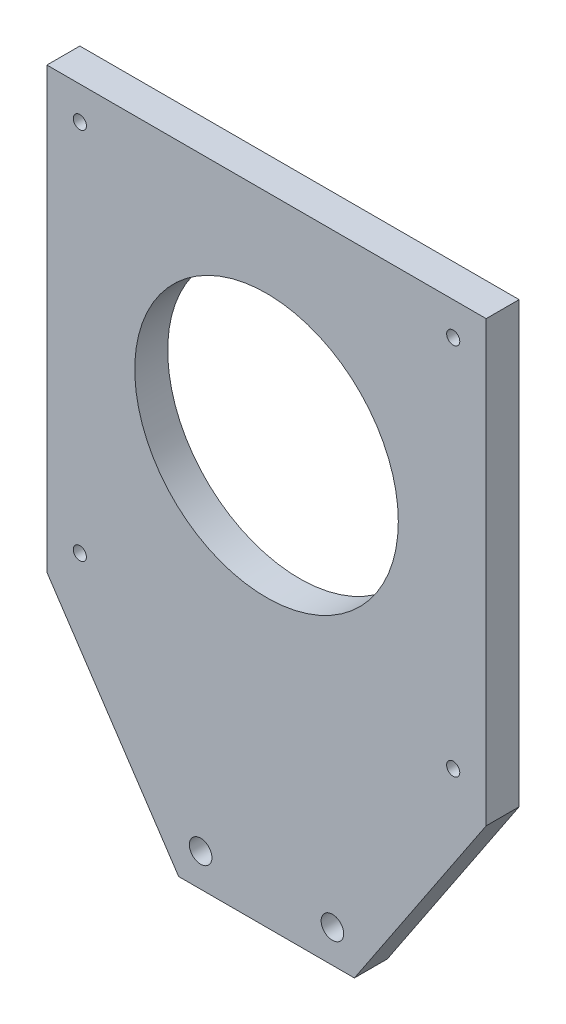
ISO-10303-21;
HEADER;
FILE_DESCRIPTION(('STEP AP214'),'2;1');
FILE_NAME('part.step','',(''),(''),'','','');
FILE_SCHEMA(('AUTOMOTIVE_DESIGN { 1 0 10303 214 1 1 1 1 }'));
ENDSEC;
DATA;
#1=APPLICATION_CONTEXT('core data for automotive mechanical design processes');
#2=APPLICATION_PROTOCOL_DEFINITION('international standard','automotive_design',2000,#1);
#3=PRODUCT_CONTEXT('',#1,'mechanical');
#4=PRODUCT('Part','Part','',(#3));
#5=PRODUCT_RELATED_PRODUCT_CATEGORY('part','',(#4));
#6=PRODUCT_DEFINITION_FORMATION('','',#4);
#7=PRODUCT_DEFINITION_CONTEXT('part definition',#1,'design');
#8=PRODUCT_DEFINITION('design','',#6,#7);
#9=PRODUCT_DEFINITION_SHAPE('','',#8);
#10=(LENGTH_UNIT() NAMED_UNIT(*) SI_UNIT(.MILLI.,.METRE.));
#11=(NAMED_UNIT(*) PLANE_ANGLE_UNIT() SI_UNIT($,.RADIAN.));
#12=(NAMED_UNIT(*) SI_UNIT($,.STERADIAN.) SOLID_ANGLE_UNIT());
#13=UNCERTAINTY_MEASURE_WITH_UNIT(LENGTH_MEASURE(1.E-05),#10,'distance_accuracy_value','');
#14=(GEOMETRIC_REPRESENTATION_CONTEXT(3) GLOBAL_UNCERTAINTY_ASSIGNED_CONTEXT((#13)) GLOBAL_UNIT_ASSIGNED_CONTEXT((#10,
#11,#12)) REPRESENTATION_CONTEXT('',''));
#15=CARTESIAN_POINT('',(0.,0.,0.));
#16=DIRECTION('',(0.,0.,1.));
#17=DIRECTION('',(1.,0.,0.));
#18=AXIS2_PLACEMENT_3D('',#15,#16,#17);
#19=CARTESIAN_POINT('',(-63.4999999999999,-63.5,9.525));
#20=DIRECTION('',(1.,0.,0.));
#21=DIRECTION('',(0.,0.,-1.));
#22=AXIS2_PLACEMENT_3D('',#19,#20,#21);
#23=PLANE('',#22);
#24=DIRECTION('',(0.,-1.,0.));
#25=VECTOR('',#24,1.);
#26=CARTESIAN_POINT('',(-63.4999999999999,-63.5,0.));
#27=LINE('',#26,#25);
#28=CARTESIAN_POINT('',(-63.4999999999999,63.5,0.));
#29=VERTEX_POINT('',#28);
#30=CARTESIAN_POINT('',(-63.4999999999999,-63.5,0.));
#31=VERTEX_POINT('',#30);
#32=EDGE_CURVE('E117',#29,#31,#27,.T.);
#33=ORIENTED_EDGE('',*,*,#32,.T.);
#34=DIRECTION('',(0.,0.,-1.));
#35=VECTOR('',#34,1.);
#36=CARTESIAN_POINT('',(-63.4999999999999,-63.5,9.525));
#37=LINE('',#36,#35);
#38=CARTESIAN_POINT('',(-63.4999999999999,-63.5,9.525));
#39=VERTEX_POINT('',#38);
#40=EDGE_CURVE('E11',#39,#31,#37,.T.);
#41=ORIENTED_EDGE('',*,*,#40,.F.);
#42=DIRECTION('',(0.,-1.,0.));
#43=VECTOR('',#42,1.);
#44=CARTESIAN_POINT('',(-63.4999999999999,-63.5,9.525));
#45=LINE('',#44,#43);
#46=CARTESIAN_POINT('',(-63.4999999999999,63.5,9.525));
#47=VERTEX_POINT('',#46);
#48=EDGE_CURVE('E128',#47,#39,#45,.T.);
#49=ORIENTED_EDGE('',*,*,#48,.F.);
#50=DIRECTION('',(0.,0.,-1.));
#51=VECTOR('',#50,1.);
#52=CARTESIAN_POINT('',(-63.4999999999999,63.5,9.525));
#53=LINE('',#52,#51);
#54=EDGE_CURVE('E113',#47,#29,#53,.T.);
#55=ORIENTED_EDGE('',*,*,#54,.T.);
#56=EDGE_LOOP('',(#33,#41,#49,#55));
#57=FACE_BOUND('',#56,.T.);
#58=ADVANCED_FACE('F33',(#57),#23,.F.);
#59=CARTESIAN_POINT('',(-25.4,-120.65,9.525));
#60=DIRECTION('',(0.832050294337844,0.554700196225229,0.));
#61=DIRECTION('',(-0.554700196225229,0.832050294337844,0.));
#62=AXIS2_PLACEMENT_3D('',#59,#60,#61);
#63=PLANE('',#62);
#64=DIRECTION('',(0.554700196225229,-0.832050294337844,0.));
#65=VECTOR('',#64,1.);
#66=CARTESIAN_POINT('',(-25.4,-120.65,0.));
#67=LINE('',#66,#65);
#68=CARTESIAN_POINT('',(-25.4,-120.65,0.));
#69=VERTEX_POINT('',#68);
#70=EDGE_CURVE('E120',#31,#69,#67,.T.);
#71=ORIENTED_EDGE('',*,*,#70,.T.);
#72=DIRECTION('',(0.,0.,-1.));
#73=VECTOR('',#72,1.);
#74=CARTESIAN_POINT('',(-25.4,-120.65,9.525));
#75=LINE('',#74,#73);
#76=CARTESIAN_POINT('',(-25.4,-120.65,9.525));
#77=VERTEX_POINT('',#76);
#78=EDGE_CURVE('E41',#77,#69,#75,.T.);
#79=ORIENTED_EDGE('',*,*,#78,.F.);
#80=DIRECTION('',(0.554700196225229,-0.832050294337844,0.));
#81=VECTOR('',#80,1.);
#82=CARTESIAN_POINT('',(-25.4,-120.65,9.525));
#83=LINE('',#82,#81);
#84=EDGE_CURVE('E86',#39,#77,#83,.T.);
#85=ORIENTED_EDGE('',*,*,#84,.F.);
#86=ORIENTED_EDGE('',*,*,#40,.T.);
#87=EDGE_LOOP('',(#71,#79,#85,#86));
#88=FACE_BOUND('',#87,.T.);
#89=ADVANCED_FACE('F154',(#88),#63,.F.);
#90=CARTESIAN_POINT('',(25.4,-120.65,9.525));
#91=DIRECTION('',(0.,1.,0.));
#92=DIRECTION('',(0.,0.,1.));
#93=AXIS2_PLACEMENT_3D('',#90,#91,#92);
#94=PLANE('',#93);
#95=DIRECTION('',(1.,0.,0.));
#96=VECTOR('',#95,1.);
#97=CARTESIAN_POINT('',(25.4,-120.65,0.));
#98=LINE('',#97,#96);
#99=CARTESIAN_POINT('',(25.4,-120.65,0.));
#100=VERTEX_POINT('',#99);
#101=EDGE_CURVE('E123',#69,#100,#98,.T.);
#102=ORIENTED_EDGE('',*,*,#101,.T.);
#103=DIRECTION('',(0.,0.,-1.));
#104=VECTOR('',#103,1.);
#105=CARTESIAN_POINT('',(25.4,-120.65,9.525));
#106=LINE('',#105,#104);
#107=CARTESIAN_POINT('',(25.4,-120.65,9.525));
#108=VERTEX_POINT('',#107);
#109=EDGE_CURVE('E108',#108,#100,#106,.T.);
#110=ORIENTED_EDGE('',*,*,#109,.F.);
#111=DIRECTION('',(1.,0.,0.));
#112=VECTOR('',#111,1.);
#113=CARTESIAN_POINT('',(25.4,-120.65,9.525));
#114=LINE('',#113,#112);
#115=EDGE_CURVE('E99',#77,#108,#114,.T.);
#116=ORIENTED_EDGE('',*,*,#115,.F.);
#117=ORIENTED_EDGE('',*,*,#78,.T.);
#118=EDGE_LOOP('',(#102,#110,#116,#117));
#119=FACE_BOUND('',#118,.T.);
#120=ADVANCED_FACE('F134',(#119),#94,.F.);
#121=CARTESIAN_POINT('',(63.5,-63.5,9.525));
#122=DIRECTION('',(-0.832050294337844,0.554700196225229,0.));
#123=DIRECTION('',(-0.554700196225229,-0.832050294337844,0.));
#124=AXIS2_PLACEMENT_3D('',#121,#122,#123);
#125=PLANE('',#124);
#126=DIRECTION('',(0.554700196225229,0.832050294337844,0.));
#127=VECTOR('',#126,1.);
#128=CARTESIAN_POINT('',(63.5,-63.5,0.));
#129=LINE('',#128,#127);
#130=CARTESIAN_POINT('',(63.5,-63.5,0.));
#131=VERTEX_POINT('',#130);
#132=EDGE_CURVE('E107',#100,#131,#129,.T.);
#133=ORIENTED_EDGE('',*,*,#132,.T.);
#134=DIRECTION('',(0.,0.,-1.));
#135=VECTOR('',#134,1.);
#136=CARTESIAN_POINT('',(63.5,-63.5,9.525));
#137=LINE('',#136,#135);
#138=CARTESIAN_POINT('',(63.5,-63.5,9.525));
#139=VERTEX_POINT('',#138);
#140=EDGE_CURVE('E104',#139,#131,#137,.T.);
#141=ORIENTED_EDGE('',*,*,#140,.F.);
#142=DIRECTION('',(0.554700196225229,0.832050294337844,0.));
#143=VECTOR('',#142,1.);
#144=CARTESIAN_POINT('',(63.5,-63.5,9.525));
#145=LINE('',#144,#143);
#146=EDGE_CURVE('E93',#108,#139,#145,.T.);
#147=ORIENTED_EDGE('',*,*,#146,.F.);
#148=ORIENTED_EDGE('',*,*,#109,.T.);
#149=EDGE_LOOP('',(#133,#141,#147,#148));
#150=FACE_BOUND('',#149,.T.);
#151=ADVANCED_FACE('F105',(#150),#125,.F.);
#152=CARTESIAN_POINT('',(63.5000000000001,63.5,9.525));
#153=DIRECTION('',(-1.,0.,0.));
#154=DIRECTION('',(0.,-1.,0.));
#155=AXIS2_PLACEMENT_3D('',#152,#153,#154);
#156=PLANE('',#155);
#157=DIRECTION('',(0.,1.,0.));
#158=VECTOR('',#157,1.);
#159=CARTESIAN_POINT('',(63.5000000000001,63.5,0.));
#160=LINE('',#159,#158);
#161=CARTESIAN_POINT('',(63.5000000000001,63.5,0.));
#162=VERTEX_POINT('',#161);
#163=EDGE_CURVE('E72',#131,#162,#160,.T.);
#164=ORIENTED_EDGE('',*,*,#163,.T.);
#165=DIRECTION('',(0.,0.,-1.));
#166=VECTOR('',#165,1.);
#167=CARTESIAN_POINT('',(63.5000000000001,63.5,9.525));
#168=LINE('',#167,#166);
#169=CARTESIAN_POINT('',(63.5000000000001,63.5,9.525));
#170=VERTEX_POINT('',#169);
#171=EDGE_CURVE('E109',#170,#162,#168,.T.);
#172=ORIENTED_EDGE('',*,*,#171,.F.);
#173=DIRECTION('',(0.,1.,0.));
#174=VECTOR('',#173,1.);
#175=CARTESIAN_POINT('',(63.5000000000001,63.5,9.525));
#176=LINE('',#175,#174);
#177=EDGE_CURVE('E97',#139,#170,#176,.T.);
#178=ORIENTED_EDGE('',*,*,#177,.F.);
#179=ORIENTED_EDGE('',*,*,#140,.T.);
#180=EDGE_LOOP('',(#164,#172,#178,#179));
#181=FACE_BOUND('',#180,.T.);
#182=ADVANCED_FACE('F111',(#181),#156,.F.);
#183=CARTESIAN_POINT('',(-63.4999999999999,63.5,9.525));
#184=DIRECTION('',(0.,-1.,0.));
#185=DIRECTION('',(0.,0.,-1.));
#186=AXIS2_PLACEMENT_3D('',#183,#184,#185);
#187=PLANE('',#186);
#188=DIRECTION('',(-1.,0.,0.));
#189=VECTOR('',#188,1.);
#190=CARTESIAN_POINT('',(-63.4999999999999,63.5,0.));
#191=LINE('',#190,#189);
#192=EDGE_CURVE('E78',#162,#29,#191,.T.);
#193=ORIENTED_EDGE('',*,*,#192,.T.);
#194=ORIENTED_EDGE('',*,*,#54,.F.);
#195=DIRECTION('',(-1.,0.,0.));
#196=VECTOR('',#195,1.);
#197=CARTESIAN_POINT('',(-63.4999999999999,63.5,9.525));
#198=LINE('',#197,#196);
#199=EDGE_CURVE('E49',#170,#47,#198,.T.);
#200=ORIENTED_EDGE('',*,*,#199,.F.);
#201=ORIENTED_EDGE('',*,*,#171,.T.);
#202=EDGE_LOOP('',(#193,#194,#200,#201));
#203=FACE_BOUND('',#202,.T.);
#204=ADVANCED_FACE('F141',(#203),#187,.F.);
#205=CARTESIAN_POINT('',(0.,0.,9.525));
#206=DIRECTION('',(0.,0.,-1.));
#207=DIRECTION('',(-1.,0.,0.));
#208=AXIS2_PLACEMENT_3D('',#205,#206,#207);
#209=PLANE('',#208);
#210=CARTESIAN_POINT('',(-53.975,53.975,9.525));
#211=DIRECTION('',(0.,0.,1.));
#212=DIRECTION('',(1.,0.,0.));
#213=AXIS2_PLACEMENT_3D('',#210,#211,#212);
#214=CIRCLE('',#213,1.89864999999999);
#215=CARTESIAN_POINT('',(-52.07635,53.975,9.525));
#216=VERTEX_POINT('',#215);
#217=EDGE_CURVE('E265',#216,#216,#214,.T.);
#218=ORIENTED_EDGE('',*,*,#217,.F.);
#219=EDGE_LOOP('',(#218));
#220=FACE_BOUND('',#219,.T.);
#221=CARTESIAN_POINT('',(53.975,53.975,9.525));
#222=DIRECTION('',(0.,0.,1.));
#223=DIRECTION('',(1.,0.,0.));
#224=AXIS2_PLACEMENT_3D('',#221,#222,#223);
#225=CIRCLE('',#224,1.89864999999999);
#226=CARTESIAN_POINT('',(55.87365,53.975,9.525));
#227=VERTEX_POINT('',#226);
#228=EDGE_CURVE('E267',#227,#227,#225,.T.);
#229=ORIENTED_EDGE('',*,*,#228,.F.);
#230=EDGE_LOOP('',(#229));
#231=FACE_BOUND('',#230,.T.);
#232=CARTESIAN_POINT('',(53.975,-53.975,9.525));
#233=DIRECTION('',(0.,0.,1.));
#234=DIRECTION('',(1.,0.,0.));
#235=AXIS2_PLACEMENT_3D('',#232,#233,#234);
#236=CIRCLE('',#235,1.89864999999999);
#237=CARTESIAN_POINT('',(55.87365,-53.975,9.525));
#238=VERTEX_POINT('',#237);
#239=EDGE_CURVE('E275',#238,#238,#236,.T.);
#240=ORIENTED_EDGE('',*,*,#239,.F.);
#241=EDGE_LOOP('',(#240));
#242=FACE_BOUND('',#241,.T.);
#243=CARTESIAN_POINT('',(-53.975,-53.975,9.525));
#244=DIRECTION('',(0.,0.,1.));
#245=DIRECTION('',(1.,0.,0.));
#246=AXIS2_PLACEMENT_3D('',#243,#244,#245);
#247=CIRCLE('',#246,1.89864999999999);
#248=CARTESIAN_POINT('',(-52.07635,-53.975,9.525));
#249=VERTEX_POINT('',#248);
#250=EDGE_CURVE('E281',#249,#249,#247,.T.);
#251=ORIENTED_EDGE('',*,*,#250,.F.);
#252=EDGE_LOOP('',(#251));
#253=FACE_BOUND('',#252,.T.);
#254=CARTESIAN_POINT('',(-19.05,-111.125,9.525));
#255=DIRECTION('',(0.,0.,1.));
#256=DIRECTION('',(1.,0.,0.));
#257=AXIS2_PLACEMENT_3D('',#254,#255,#256);
#258=CIRCLE('',#257,3.26389999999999);
#259=CARTESIAN_POINT('',(-15.7861,-111.125,9.525));
#260=VERTEX_POINT('',#259);
#261=EDGE_CURVE('E287',#260,#260,#258,.T.);
#262=ORIENTED_EDGE('',*,*,#261,.F.);
#263=EDGE_LOOP('',(#262));
#264=FACE_BOUND('',#263,.T.);
#265=CARTESIAN_POINT('',(19.05,-111.125,9.525));
#266=DIRECTION('',(0.,0.,1.));
#267=DIRECTION('',(1.,0.,0.));
#268=AXIS2_PLACEMENT_3D('',#265,#266,#267);
#269=CIRCLE('',#268,3.26389999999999);
#270=CARTESIAN_POINT('',(22.3139,-111.125,9.525));
#271=VERTEX_POINT('',#270);
#272=EDGE_CURVE('E293',#271,#271,#269,.T.);
#273=ORIENTED_EDGE('',*,*,#272,.F.);
#274=EDGE_LOOP('',(#273));
#275=FACE_BOUND('',#274,.T.);
#276=CARTESIAN_POINT('',(0.,0.,9.525));
#277=DIRECTION('',(0.,0.,1.));
#278=DIRECTION('',(1.,0.,0.));
#279=AXIS2_PLACEMENT_3D('',#276,#277,#278);
#280=CIRCLE('',#279,38.1);
#281=CARTESIAN_POINT('',(38.1,0.,9.525));
#282=VERTEX_POINT('',#281);
#283=EDGE_CURVE('E299',#282,#282,#280,.T.);
#284=ORIENTED_EDGE('',*,*,#283,.F.);
#285=EDGE_LOOP('',(#284));
#286=FACE_BOUND('',#285,.T.);
#287=ORIENTED_EDGE('',*,*,#48,.T.);
#288=ORIENTED_EDGE('',*,*,#84,.T.);
#289=ORIENTED_EDGE('',*,*,#115,.T.);
#290=ORIENTED_EDGE('',*,*,#146,.T.);
#291=ORIENTED_EDGE('',*,*,#177,.T.);
#292=ORIENTED_EDGE('',*,*,#199,.T.);
#293=EDGE_LOOP('',(#287,#288,#289,#290,#291,#292));
#294=FACE_BOUND('',#293,.T.);
#295=ADVANCED_FACE('F95',(#220,#231,#242,#253,#264,#275,#286,#294),#209,.F.);
#296=CARTESIAN_POINT('',(0.,0.,0.));
#297=DIRECTION('',(0.,0.,-1.));
#298=DIRECTION('',(-1.,0.,0.));
#299=AXIS2_PLACEMENT_3D('',#296,#297,#298);
#300=PLANE('',#299);
#301=CARTESIAN_POINT('',(-53.975,53.975,0.));
#302=DIRECTION('',(0.,0.,1.));
#303=DIRECTION('',(1.,0.,0.));
#304=AXIS2_PLACEMENT_3D('',#301,#302,#303);
#305=CIRCLE('',#304,1.89864999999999);
#306=CARTESIAN_POINT('',(-52.07635,53.975,0.));
#307=VERTEX_POINT('',#306);
#308=EDGE_CURVE('E262',#307,#307,#305,.T.);
#309=ORIENTED_EDGE('',*,*,#308,.T.);
#310=EDGE_LOOP('',(#309));
#311=FACE_BOUND('',#310,.T.);
#312=CARTESIAN_POINT('',(53.975,53.975,0.));
#313=DIRECTION('',(0.,0.,1.));
#314=DIRECTION('',(1.,0.,0.));
#315=AXIS2_PLACEMENT_3D('',#312,#313,#314);
#316=CIRCLE('',#315,1.89864999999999);
#317=CARTESIAN_POINT('',(55.87365,53.975,0.));
#318=VERTEX_POINT('',#317);
#319=EDGE_CURVE('E272',#318,#318,#316,.T.);
#320=ORIENTED_EDGE('',*,*,#319,.T.);
#321=EDGE_LOOP('',(#320));
#322=FACE_BOUND('',#321,.T.);
#323=CARTESIAN_POINT('',(53.975,-53.975,0.));
#324=DIRECTION('',(0.,0.,1.));
#325=DIRECTION('',(1.,0.,0.));
#326=AXIS2_PLACEMENT_3D('',#323,#324,#325);
#327=CIRCLE('',#326,1.89864999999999);
#328=CARTESIAN_POINT('',(55.87365,-53.975,0.));
#329=VERTEX_POINT('',#328);
#330=EDGE_CURVE('E278',#329,#329,#327,.T.);
#331=ORIENTED_EDGE('',*,*,#330,.T.);
#332=EDGE_LOOP('',(#331));
#333=FACE_BOUND('',#332,.T.);
#334=CARTESIAN_POINT('',(-53.975,-53.975,0.));
#335=DIRECTION('',(0.,0.,1.));
#336=DIRECTION('',(1.,0.,0.));
#337=AXIS2_PLACEMENT_3D('',#334,#335,#336);
#338=CIRCLE('',#337,1.89864999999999);
#339=CARTESIAN_POINT('',(-52.07635,-53.975,0.));
#340=VERTEX_POINT('',#339);
#341=EDGE_CURVE('E284',#340,#340,#338,.T.);
#342=ORIENTED_EDGE('',*,*,#341,.T.);
#343=EDGE_LOOP('',(#342));
#344=FACE_BOUND('',#343,.T.);
#345=CARTESIAN_POINT('',(-19.05,-111.125,0.));
#346=DIRECTION('',(0.,0.,1.));
#347=DIRECTION('',(1.,0.,0.));
#348=AXIS2_PLACEMENT_3D('',#345,#346,#347);
#349=CIRCLE('',#348,3.2639);
#350=CARTESIAN_POINT('',(-15.7861,-111.125,0.));
#351=VERTEX_POINT('',#350);
#352=EDGE_CURVE('E290',#351,#351,#349,.T.);
#353=ORIENTED_EDGE('',*,*,#352,.T.);
#354=EDGE_LOOP('',(#353));
#355=FACE_BOUND('',#354,.T.);
#356=CARTESIAN_POINT('',(19.05,-111.125,0.));
#357=DIRECTION('',(0.,0.,1.));
#358=DIRECTION('',(1.,0.,0.));
#359=AXIS2_PLACEMENT_3D('',#356,#357,#358);
#360=CIRCLE('',#359,3.2639);
#361=CARTESIAN_POINT('',(22.3139,-111.125,0.));
#362=VERTEX_POINT('',#361);
#363=EDGE_CURVE('E296',#362,#362,#360,.T.);
#364=ORIENTED_EDGE('',*,*,#363,.T.);
#365=EDGE_LOOP('',(#364));
#366=FACE_BOUND('',#365,.T.);
#367=CARTESIAN_POINT('',(0.,0.,0.));
#368=DIRECTION('',(0.,0.,1.));
#369=DIRECTION('',(1.,0.,0.));
#370=AXIS2_PLACEMENT_3D('',#367,#368,#369);
#371=CIRCLE('',#370,38.1);
#372=CARTESIAN_POINT('',(38.1,0.,0.));
#373=VERTEX_POINT('',#372);
#374=EDGE_CURVE('E121',#373,#373,#371,.T.);
#375=ORIENTED_EDGE('',*,*,#374,.T.);
#376=EDGE_LOOP('',(#375));
#377=FACE_BOUND('',#376,.T.);
#378=ORIENTED_EDGE('',*,*,#32,.F.);
#379=ORIENTED_EDGE('',*,*,#192,.F.);
#380=ORIENTED_EDGE('',*,*,#163,.F.);
#381=ORIENTED_EDGE('',*,*,#132,.F.);
#382=ORIENTED_EDGE('',*,*,#101,.F.);
#383=ORIENTED_EDGE('',*,*,#70,.F.);
#384=EDGE_LOOP('',(#378,#379,#380,#381,#382,#383));
#385=FACE_BOUND('',#384,.T.);
#386=ADVANCED_FACE('F137',(#311,#322,#333,#344,#355,#366,#377,#385),#300,.T.);
#387=CARTESIAN_POINT('',(0.,0.,0.));
#388=DIRECTION('',(0.,0.,1.));
#389=DIRECTION('',(1.,0.,0.));
#390=AXIS2_PLACEMENT_3D('',#387,#388,#389);
#391=CYLINDRICAL_SURFACE('',#390,38.1);
#392=CARTESIAN_POINT('',(38.1,0.,0.));
#393=CARTESIAN_POINT('',(38.1,0.,0.0992187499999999));
#394=CARTESIAN_POINT('',(38.1,0.,0.1984375));
#395=CARTESIAN_POINT('',(38.1,0.,0.396875));
#396=CARTESIAN_POINT('',(38.1,0.,0.49609375));
#397=CARTESIAN_POINT('',(38.1,0.,0.69453125));
#398=CARTESIAN_POINT('',(38.1,0.,0.79375));
#399=CARTESIAN_POINT('',(38.1,0.,0.9921875));
#400=CARTESIAN_POINT('',(38.1,0.,1.09140625));
#401=CARTESIAN_POINT('',(38.1,0.,1.28984375));
#402=CARTESIAN_POINT('',(38.1,0.,1.3890625));
#403=CARTESIAN_POINT('',(38.1,0.,1.5875));
#404=CARTESIAN_POINT('',(38.1,0.,1.68671875));
#405=CARTESIAN_POINT('',(38.1,0.,1.88515625));
#406=CARTESIAN_POINT('',(38.1,0.,1.984375));
#407=CARTESIAN_POINT('',(38.1,0.,2.1828125));
#408=CARTESIAN_POINT('',(38.1,0.,2.28203125));
#409=CARTESIAN_POINT('',(38.1,0.,2.48046875));
#410=CARTESIAN_POINT('',(38.1,0.,2.5796875));
#411=CARTESIAN_POINT('',(38.1,0.,2.778125));
#412=CARTESIAN_POINT('',(38.1,0.,2.87734375));
#413=CARTESIAN_POINT('',(38.1,0.,3.07578125));
#414=CARTESIAN_POINT('',(38.1,0.,3.175));
#415=CARTESIAN_POINT('',(38.1,0.,3.3734375));
#416=CARTESIAN_POINT('',(38.1,0.,3.47265625));
#417=CARTESIAN_POINT('',(38.1,0.,3.67109375));
#418=CARTESIAN_POINT('',(38.1,0.,3.7703125));
#419=CARTESIAN_POINT('',(38.1,0.,3.96875));
#420=CARTESIAN_POINT('',(38.1,0.,4.06796875));
#421=CARTESIAN_POINT('',(38.1,0.,4.26640625));
#422=CARTESIAN_POINT('',(38.1,0.,4.365625));
#423=CARTESIAN_POINT('',(38.1,0.,4.5640625));
#424=CARTESIAN_POINT('',(38.1,0.,4.66328125));
#425=CARTESIAN_POINT('',(38.1,0.,4.86171875));
#426=CARTESIAN_POINT('',(38.1,0.,4.9609375));
#427=CARTESIAN_POINT('',(38.1,0.,5.159375));
#428=CARTESIAN_POINT('',(38.1,0.,5.25859375));
#429=CARTESIAN_POINT('',(38.1,0.,5.45703125));
#430=CARTESIAN_POINT('',(38.1,0.,5.55625));
#431=CARTESIAN_POINT('',(38.1,0.,5.7546875));
#432=CARTESIAN_POINT('',(38.1,0.,5.85390625));
#433=CARTESIAN_POINT('',(38.1,0.,6.05234375));
#434=CARTESIAN_POINT('',(38.1,0.,6.1515625));
#435=CARTESIAN_POINT('',(38.1,0.,6.35));
#436=CARTESIAN_POINT('',(38.1,0.,6.44921875));
#437=CARTESIAN_POINT('',(38.1,0.,6.64765625));
#438=CARTESIAN_POINT('',(38.1,0.,6.746875));
#439=CARTESIAN_POINT('',(38.1,0.,6.9453125));
#440=CARTESIAN_POINT('',(38.1,0.,7.04453125));
#441=CARTESIAN_POINT('',(38.1,0.,7.24296875));
#442=CARTESIAN_POINT('',(38.1,0.,7.3421875));
#443=CARTESIAN_POINT('',(38.1,0.,7.540625));
#444=CARTESIAN_POINT('',(38.1,0.,7.63984375));
#445=CARTESIAN_POINT('',(38.1,0.,7.83828125));
#446=CARTESIAN_POINT('',(38.1,0.,7.9375));
#447=CARTESIAN_POINT('',(38.1,0.,8.1359375));
#448=CARTESIAN_POINT('',(38.1,0.,8.23515625));
#449=CARTESIAN_POINT('',(38.1,0.,8.43359375));
#450=CARTESIAN_POINT('',(38.1,0.,8.5328125));
#451=CARTESIAN_POINT('',(38.1,0.,8.73125));
#452=CARTESIAN_POINT('',(38.1,0.,8.83046875));
#453=CARTESIAN_POINT('',(38.1,0.,9.02890625));
#454=CARTESIAN_POINT('',(38.1,0.,9.128125));
#455=CARTESIAN_POINT('',(38.1,0.,9.3265625));
#456=CARTESIAN_POINT('',(38.1,0.,9.42578125));
#457=CARTESIAN_POINT('',(38.1,0.,9.525));
#458=B_SPLINE_CURVE_WITH_KNOTS('',3,(#392,#393,#394,#395,#396,#397,#398,#399,#400,#401,#402,
#403,#404,#405,#406,#407,#408,#409,#410,#411,#412,#413,#414,#415,#416,#417,#418,#419,#420,#421,
#422,#423,#424,#425,#426,#427,#428,#429,#430,#431,#432,#433,#434,#435,#436,#437,#438,#439,#440,
#441,#442,#443,#444,#445,#446,#447,#448,#449,#450,#451,#452,#453,#454,#455,#456,#457),
.UNSPECIFIED.,.F.,.F.,(4,2,2,2,2,2,2,2,2,2,2,2,2,2,2,2,2,2,2,2,2,2,2,2,2,2,2,2,2,2,2,2,4),(0.,
0.29765625,0.5953125,0.89296875,1.190625,1.48828125,1.7859375,2.08359375,2.38125,2.67890625,
2.9765625,3.27421875,3.571875,3.86953125,4.1671875,4.46484375,4.7625,5.06015625,5.3578125,
5.65546875,5.953125,6.25078125,6.5484375,6.84609375,7.14375,7.44140625,7.7390625,8.03671875,
8.334375,8.63203125,8.9296875,9.22734375,9.525),.UNSPECIFIED.);
#459=EDGE_CURVE('BSEAM182',#373,#282,#458,.T.);
#460=ORIENTED_EDGE('',*,*,#374,.F.);
#461=ORIENTED_EDGE('',*,*,#283,.T.);
#462=ORIENTED_EDGE('',*,*,#459,.T.);
#463=ORIENTED_EDGE('',*,*,#459,.F.);
#464=EDGE_LOOP('',(#460,#462,#461,#463));
#465=FACE_BOUND('',#464,.T.);
#466=ADVANCED_FACE('F182',(#465),#391,.F.);
#467=CARTESIAN_POINT('',(19.05,-111.125,9.525));
#468=DIRECTION('',(0.,0.,1.));
#469=DIRECTION('',(1.,0.,0.));
#470=AXIS2_PLACEMENT_3D('',#467,#468,#469);
#471=CYLINDRICAL_SURFACE('',#470,3.2639);
#472=ORIENTED_EDGE('',*,*,#363,.F.);
#473=EDGE_LOOP('',(#472));
#474=FACE_BOUND('',#473,.T.);
#475=ORIENTED_EDGE('',*,*,#272,.T.);
#476=EDGE_LOOP('',(#475));
#477=FACE_BOUND('',#476,.T.);
#478=ADVANCED_FACE('F187',(#474,#477),#471,.F.);
#479=CARTESIAN_POINT('',(-19.05,-111.125,9.525));
#480=DIRECTION('',(0.,0.,1.));
#481=DIRECTION('',(1.,0.,0.));
#482=AXIS2_PLACEMENT_3D('',#479,#480,#481);
#483=CYLINDRICAL_SURFACE('',#482,3.2639);
#484=ORIENTED_EDGE('',*,*,#352,.F.);
#485=EDGE_LOOP('',(#484));
#486=FACE_BOUND('',#485,.T.);
#487=ORIENTED_EDGE('',*,*,#261,.T.);
#488=EDGE_LOOP('',(#487));
#489=FACE_BOUND('',#488,.T.);
#490=ADVANCED_FACE('F199',(#486,#489),#483,.F.);
#491=CARTESIAN_POINT('',(-53.975,-53.975,9.525));
#492=DIRECTION('',(0.,0.,1.));
#493=DIRECTION('',(1.,0.,0.));
#494=AXIS2_PLACEMENT_3D('',#491,#492,#493);
#495=CYLINDRICAL_SURFACE('',#494,1.89864999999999);
#496=ORIENTED_EDGE('',*,*,#341,.F.);
#497=EDGE_LOOP('',(#496));
#498=FACE_BOUND('',#497,.T.);
#499=ORIENTED_EDGE('',*,*,#250,.T.);
#500=EDGE_LOOP('',(#499));
#501=FACE_BOUND('',#500,.T.);
#502=ADVANCED_FACE('F208',(#498,#501),#495,.F.);
#503=CARTESIAN_POINT('',(53.975,-53.975,9.525));
#504=DIRECTION('',(0.,0.,1.));
#505=DIRECTION('',(1.,0.,0.));
#506=AXIS2_PLACEMENT_3D('',#503,#504,#505);
#507=CYLINDRICAL_SURFACE('',#506,1.89864999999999);
#508=ORIENTED_EDGE('',*,*,#330,.F.);
#509=EDGE_LOOP('',(#508));
#510=FACE_BOUND('',#509,.T.);
#511=ORIENTED_EDGE('',*,*,#239,.T.);
#512=EDGE_LOOP('',(#511));
#513=FACE_BOUND('',#512,.T.);
#514=ADVANCED_FACE('F225',(#510,#513),#507,.F.);
#515=CARTESIAN_POINT('',(53.975,53.975,9.525));
#516=DIRECTION('',(0.,0.,1.));
#517=DIRECTION('',(1.,0.,0.));
#518=AXIS2_PLACEMENT_3D('',#515,#516,#517);
#519=CYLINDRICAL_SURFACE('',#518,1.89864999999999);
#520=ORIENTED_EDGE('',*,*,#319,.F.);
#521=EDGE_LOOP('',(#520));
#522=FACE_BOUND('',#521,.T.);
#523=ORIENTED_EDGE('',*,*,#228,.T.);
#524=EDGE_LOOP('',(#523));
#525=FACE_BOUND('',#524,.T.);
#526=ADVANCED_FACE('F235',(#522,#525),#519,.F.);
#527=CARTESIAN_POINT('',(-53.975,53.975,9.525));
#528=DIRECTION('',(0.,0.,1.));
#529=DIRECTION('',(1.,0.,0.));
#530=AXIS2_PLACEMENT_3D('',#527,#528,#529);
#531=CYLINDRICAL_SURFACE('',#530,1.89864999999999);
#532=ORIENTED_EDGE('',*,*,#308,.F.);
#533=EDGE_LOOP('',(#532));
#534=FACE_BOUND('',#533,.T.);
#535=ORIENTED_EDGE('',*,*,#217,.T.);
#536=EDGE_LOOP('',(#535));
#537=FACE_BOUND('',#536,.T.);
#538=ADVANCED_FACE('F245',(#534,#537),#531,.F.);
#539=CLOSED_SHELL('',(#58,#89,#120,#151,#182,#204,#295,#386,#466,#478,#490,#502,#514,#526,#538));
#540=MANIFOLD_SOLID_BREP('B2',#539);
#541=ADVANCED_BREP_SHAPE_REPRESENTATION('',(#18,#540),#14);
#542=SHAPE_DEFINITION_REPRESENTATION(#9,#541);
ENDSEC;
END-ISO-10303-21;
